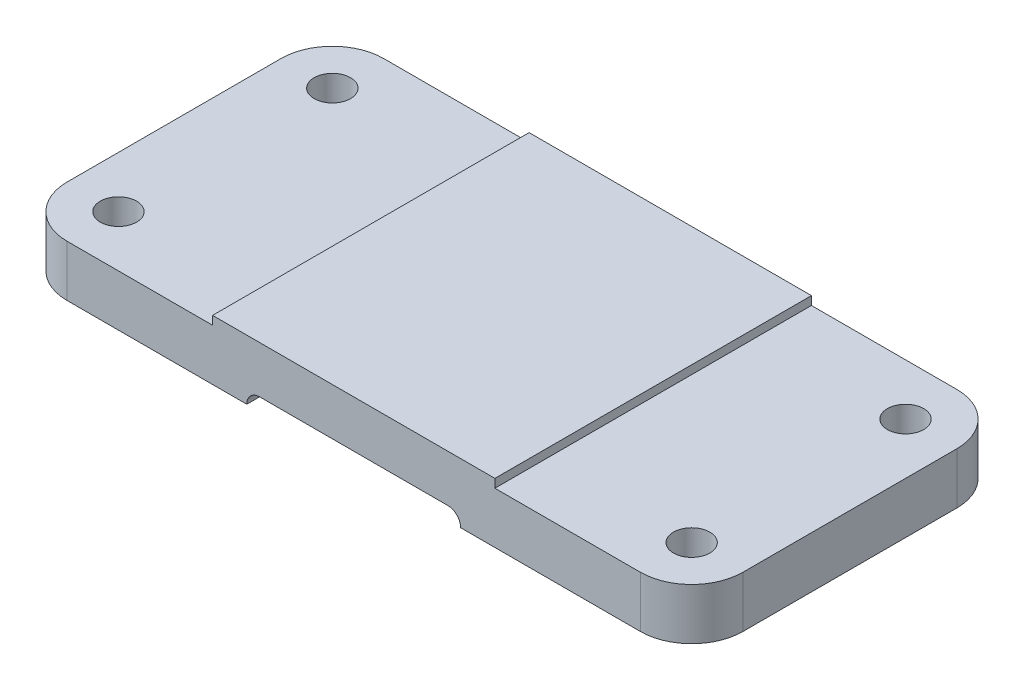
from build123d import *

# Parameters (mm, degrees)
BOSS_EXTRUDE1_DEPTH    = 74
FILLET1_R              = 12
M10_TAPPED_HOLE1_D     = 8.5
M10_TAPPED_HOLE1_DEPTH = 24.5
M10_TAPPED_HOLE1_TIP   = 2.553657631


with BuildPart() as part:
    # Sketch1 → Boss-Extrude1 (new body)
    with BuildSketch(Plane.XY):
        with BuildLine():
            Line((-8.61784001, -8.193885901), (35.38215999, -8.193885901))
            ThreePointArc((35.38215999, -8.193885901), (37.503480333, -9.072565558), (38.38215999, -11.193885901))
            Line((38.38215999, -11.193885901), (92.38215999, -11.193885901))
            Line((92.38215999, -11.193885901), (92.38215999, 0.806114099))
            Line((92.38215999, 0.806114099), (46.38215999, 0.806114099))
            Line((46.38215999, 0.806114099), (46.38215999, 2.806114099))
            Line((46.38215999, 2.806114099), (-19.61784001, 2.806114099))
            Line((-19.61784001, 2.806114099), (-19.61784001, 0.806114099))
            Line((-19.61784001, 0.806114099), (-65.61784001, 0.806114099))
            Line((-65.61784001, 0.806114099), (-65.61784001, -11.193885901))
            Line((-65.61784001, -11.193885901), (-11.61784001, -11.193885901))
            ThreePointArc((-11.61784001, -11.193885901), (-10.739160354, -9.072565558), (-8.61784001, -8.193885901))
        make_face()
    extrude(amount=BOSS_EXTRUDE1_DEPTH)

    # Fillet1
    fillet1_edges = [part.edges().sort_by_distance(p)[0] for p in [
        (-65.61784001, -5.193885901, 74),
        (92.38215999, -5.193885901, 0),
        (-65.61784001, -5.193885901, 0),
        (92.38215999, -5.193885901, 74),
    ]]
    fillet(fillet1_edges, radius=FILLET1_R)

    # M10 Tapped Hole1
    with Locations(Plane(origin=(80.38215999, 0.806114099, 62), x_dir=(0, 0, 1), z_dir=(0, 1, 0))):
        with Locations((0, 0), (-50, 0), (-50, -134), (0, -134)):
            Hole(M10_TAPPED_HOLE1_D / 2, depth=M10_TAPPED_HOLE1_DEPTH)
            with Locations((0, 0, -(M10_TAPPED_HOLE1_DEPTH + M10_TAPPED_HOLE1_TIP / 2))):  # 118° drill point
                Cone(0, M10_TAPPED_HOLE1_D / 2, M10_TAPPED_HOLE1_TIP, mode=Mode.SUBTRACT)


solid = part.part
